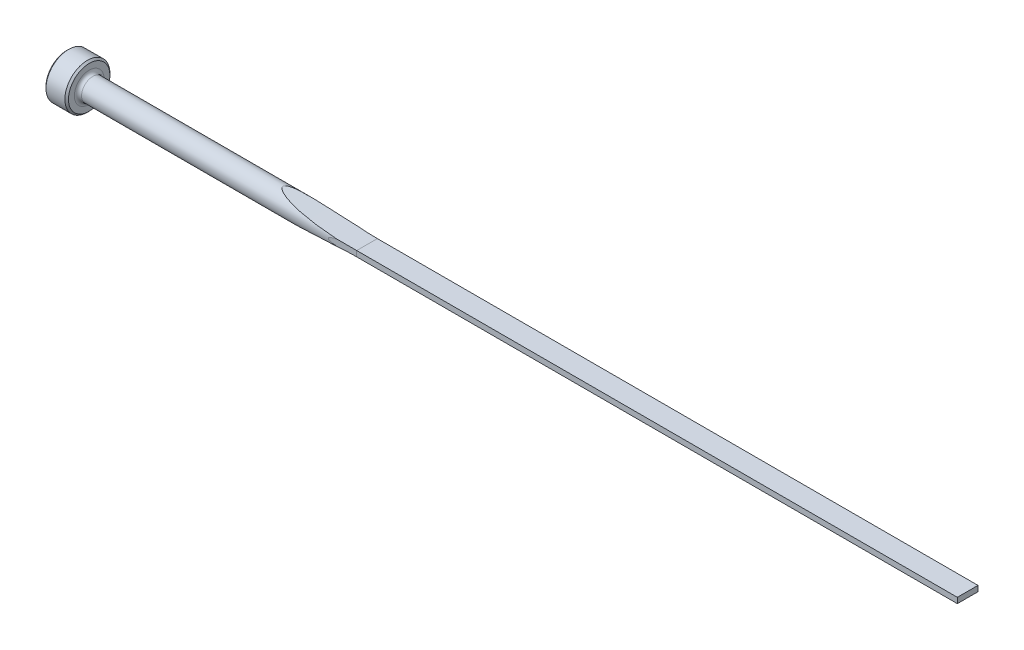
ISO-10303-21;
HEADER;
FILE_DESCRIPTION(('STEP AP214'),'2;1');
FILE_NAME('part.step','',(''),(''),'','','');
FILE_SCHEMA(('AUTOMOTIVE_DESIGN { 1 0 10303 214 1 1 1 1 }'));
ENDSEC;
DATA;
#1=APPLICATION_CONTEXT('core data for automotive mechanical design processes');
#2=APPLICATION_PROTOCOL_DEFINITION('international standard','automotive_design',2000,#1);
#3=PRODUCT_CONTEXT('',#1,'mechanical');
#4=PRODUCT('Part','Part','',(#3));
#5=PRODUCT_RELATED_PRODUCT_CATEGORY('part','',(#4));
#6=PRODUCT_DEFINITION_FORMATION('','',#4);
#7=PRODUCT_DEFINITION_CONTEXT('part definition',#1,'design');
#8=PRODUCT_DEFINITION('design','',#6,#7);
#9=PRODUCT_DEFINITION_SHAPE('','',#8);
#10=(LENGTH_UNIT() NAMED_UNIT(*) SI_UNIT(.MILLI.,.METRE.));
#11=(NAMED_UNIT(*) PLANE_ANGLE_UNIT() SI_UNIT($,.RADIAN.));
#12=(NAMED_UNIT(*) SI_UNIT($,.STERADIAN.) SOLID_ANGLE_UNIT());
#13=UNCERTAINTY_MEASURE_WITH_UNIT(LENGTH_MEASURE(1.E-05),#10,'distance_accuracy_value','');
#14=(GEOMETRIC_REPRESENTATION_CONTEXT(3) GLOBAL_UNCERTAINTY_ASSIGNED_CONTEXT((#13)) GLOBAL_UNIT_ASSIGNED_CONTEXT((#10,
#11,#12)) REPRESENTATION_CONTEXT('',''));
#15=CARTESIAN_POINT('',(0.,0.,0.));
#16=DIRECTION('',(0.,0.,1.));
#17=DIRECTION('',(1.,0.,0.));
#18=AXIS2_PLACEMENT_3D('',#15,#16,#17);
#19=CARTESIAN_POINT('',(0.,0.,0.));
#20=DIRECTION('',(-1.,0.,0.));
#21=DIRECTION('',(0.,0.,1.));
#22=AXIS2_PLACEMENT_3D('',#19,#20,#21);
#23=CYLINDRICAL_SURFACE('',#22,2.3749);
#24=CARTESIAN_POINT('',(5.5118,0.,0.));
#25=DIRECTION('',(-1.,0.,0.));
#26=DIRECTION('',(0.,0.,1.));
#27=AXIS2_PLACEMENT_3D('',#24,#25,#26);
#28=CIRCLE('',#27,2.3749);
#29=CARTESIAN_POINT('',(5.5118,0.,2.3749));
#30=VERTEX_POINT('',#29);
#31=EDGE_CURVE('E153',#30,#30,#28,.F.);
#32=ORIENTED_EDGE('',*,*,#31,.T.);
#33=EDGE_LOOP('',(#32));
#34=FACE_BOUND('',#33,.T.);
#35=CARTESIAN_POINT('',(63.5,0.931958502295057,2.18439999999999));
#36=CARTESIAN_POINT('',(63.3075515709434,0.931940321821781,2.18439976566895));
#37=CARTESIAN_POINT('',(63.1151013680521,0.930492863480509,2.18502490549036));
#38=CARTESIAN_POINT('',(62.7302234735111,0.92461137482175,2.18752450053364));
#39=CARTESIAN_POINT('',(62.5377957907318,0.920176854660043,2.18939916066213));
#40=CARTESIAN_POINT('',(62.1518341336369,0.908155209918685,2.19441218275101));
#41=CARTESIAN_POINT('',(61.9583008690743,0.900548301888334,2.19755847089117));
#42=CARTESIAN_POINT('',(61.5714442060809,0.881895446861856,2.20511052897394));
#43=CARTESIAN_POINT('',(61.3781207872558,0.870849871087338,2.20951616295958));
#44=CARTESIAN_POINT('',(60.9803005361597,0.844100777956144,2.21987943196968));
#45=CARTESIAN_POINT('',(60.7758212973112,0.828159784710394,2.2259136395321));
#46=CARTESIAN_POINT('',(60.3673129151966,0.791030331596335,2.23937732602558));
#47=CARTESIAN_POINT('',(60.1632839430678,0.769840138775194,2.24680726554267));
#48=CARTESIAN_POINT('',(59.75661740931,0.720830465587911,2.26301546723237));
#49=CARTESIAN_POINT('',(59.5539775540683,0.693029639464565,2.27178991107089));
#50=CARTESIAN_POINT('',(59.2512709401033,0.644172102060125,2.28592867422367));
#51=CARTESIAN_POINT('',(59.150603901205,0.626699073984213,2.29080303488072));
#52=CARTESIAN_POINT('',(58.9498678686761,0.588702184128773,2.30086330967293));
#53=CARTESIAN_POINT('',(58.8497987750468,0.568178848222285,2.30604917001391));
#54=CARTESIAN_POINT('',(58.7018199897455,0.534634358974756,2.31396676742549));
#55=CARTESIAN_POINT('',(58.6535509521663,0.523182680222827,2.3165891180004));
#56=CARTESIAN_POINT('',(58.5573085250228,0.499097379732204,2.32189592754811));
#57=CARTESIAN_POINT('',(58.5093351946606,0.486463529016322,2.32458039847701));
#58=CARTESIAN_POINT('',(58.3663526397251,0.446582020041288,2.33269738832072));
#59=CARTESIAN_POINT('',(58.2718724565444,0.417265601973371,2.33821536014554));
#60=CARTESIAN_POINT('',(58.1453639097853,0.370835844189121,2.34580058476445));
#61=CARTESIAN_POINT('',(58.1118331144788,0.357819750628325,2.34783049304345));
#62=CARTESIAN_POINT('',(58.0453758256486,0.330089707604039,2.35189084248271));
#63=CARTESIAN_POINT('',(58.01245087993,0.315371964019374,2.35392127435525));
#64=CARTESIAN_POINT('',(57.9466649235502,0.28318239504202,2.35801388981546));
#65=CARTESIAN_POINT('',(57.9138393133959,0.265637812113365,2.36007502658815));
#66=CARTESIAN_POINT('',(57.8503018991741,0.227094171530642,2.36409846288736));
#67=CARTESIAN_POINT('',(57.8195817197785,0.206110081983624,2.36606114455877));
#68=CARTESIAN_POINT('',(57.7807522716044,0.17363214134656,2.36855971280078));
#69=CARTESIAN_POINT('',(57.7706531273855,0.164553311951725,2.36921145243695));
#70=CARTESIAN_POINT('',(57.751335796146,0.145453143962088,2.3704611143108));
#71=CARTESIAN_POINT('',(57.7421190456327,0.135430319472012,2.3710589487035));
#72=CARTESIAN_POINT('',(57.7248924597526,0.114162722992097,2.372178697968));
#73=CARTESIAN_POINT('',(57.7168989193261,0.10290439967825,2.3726995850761));
#74=CARTESIAN_POINT('',(57.7029630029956,0.0791761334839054,2.37360916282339));
#75=CARTESIAN_POINT('',(57.6970130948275,0.0667108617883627,2.37399833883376));
#76=CARTESIAN_POINT('',(57.6895493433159,0.0451214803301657,2.37448695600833));
#77=CARTESIAN_POINT('',(57.687216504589,0.0362843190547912,2.37463982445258));
#78=CARTESIAN_POINT('',(57.684070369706,0.018342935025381,2.3748460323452));
#79=CARTESIAN_POINT('',(57.68325542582,0.00923901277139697,2.37489947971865));
#80=CARTESIAN_POINT('',(57.6832396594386,-0.00898512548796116,2.37490051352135));
#81=CARTESIAN_POINT('',(57.6840414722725,-0.0181053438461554,2.37484792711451));
#82=CARTESIAN_POINT('',(57.6871682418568,-0.0360804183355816,2.37464298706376));
#83=CARTESIAN_POINT('',(57.6894948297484,-0.0449349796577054,2.37449052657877));
#84=CARTESIAN_POINT('',(57.696426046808,-0.0650505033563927,2.37403676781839));
#85=CARTESIAN_POINT('',(57.7015301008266,-0.0761364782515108,2.37370288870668));
#86=CARTESIAN_POINT('',(57.7134090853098,-0.0973644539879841,2.37292722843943));
#87=CARTESIAN_POINT('',(57.720188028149,-0.10750410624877,2.37248518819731));
#88=CARTESIAN_POINT('',(57.7406526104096,-0.134467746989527,2.37115359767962));
#89=CARTESIAN_POINT('',(57.7555945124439,-0.150320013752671,2.37018436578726));
#90=CARTESIAN_POINT('',(57.7874630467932,-0.179846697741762,2.36812651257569));
#91=CARTESIAN_POINT('',(57.8043958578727,-0.193514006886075,2.36703752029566));
#92=CARTESIAN_POINT('',(57.8500057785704,-0.226993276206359,2.36411848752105));
#93=CARTESIAN_POINT('',(57.8796018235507,-0.245533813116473,2.36223795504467));
#94=CARTESIAN_POINT('',(57.9403493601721,-0.279898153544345,2.3584104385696));
#95=CARTESIAN_POINT('',(57.9715045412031,-0.295715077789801,2.35646330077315));
#96=CARTESIAN_POINT('',(58.0666093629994,-0.34041895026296,2.35057165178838));
#97=CARTESIAN_POINT('',(58.1319170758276,-0.366382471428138,2.34659497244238));
#98=CARTESIAN_POINT('',(58.2741782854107,-0.417382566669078,2.3380950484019));
#99=CARTESIAN_POINT('',(58.3513848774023,-0.441669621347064,2.33358126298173));
#100=CARTESIAN_POINT('',(58.506961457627,-0.486276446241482,2.32469268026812));
#101=CARTESIAN_POINT('',(58.5853319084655,-0.506594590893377,2.32031794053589));
#102=CARTESIAN_POINT('',(58.8218439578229,-0.563416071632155,2.30743335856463));
#103=CARTESIAN_POINT('',(58.9810064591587,-0.595665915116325,2.29918591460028));
#104=CARTESIAN_POINT('',(59.3005735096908,-0.653182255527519,2.28349651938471));
#105=CARTESIAN_POINT('',(59.46097818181,-0.678448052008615,2.27605464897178));
#106=CARTESIAN_POINT('',(59.7823165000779,-0.723854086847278,2.26202300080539));
#107=CARTESIAN_POINT('',(59.9432491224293,-0.744001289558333,2.25543207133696));
#108=CARTESIAN_POINT('',(60.3686966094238,-0.792003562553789,2.23917011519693));
#109=CARTESIAN_POINT('',(60.6336093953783,-0.816543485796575,2.23022625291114));
#110=CARTESIAN_POINT('',(61.1642384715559,-0.857758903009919,2.21469349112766));
#111=CARTESIAN_POINT('',(61.4299551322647,-0.874429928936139,2.20810593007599));
#112=CARTESIAN_POINT('',(61.9612705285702,-0.901186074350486,2.19732116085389));
#113=CARTESIAN_POINT('',(62.2268685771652,-0.911283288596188,2.19311956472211));
#114=CARTESIAN_POINT('',(62.7582486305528,-0.925643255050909,2.18709742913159));
#115=CARTESIAN_POINT('',(63.0240306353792,-0.929906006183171,2.18527689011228));
#116=CARTESIAN_POINT('',(63.3598826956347,-0.931763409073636,2.18448280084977));
#117=CARTESIAN_POINT('',(63.4299416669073,-0.931956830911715,2.18439997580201));
#118=CARTESIAN_POINT('',(63.5,-0.931958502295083,2.18439999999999));
#119=B_SPLINE_CURVE_WITH_KNOTS('',3,(#35,#36,#37,#38,#39,#40,#41,#42,#43,#44,#45,#46,#47,#48,
#49,#50,#51,#52,#53,#54,#55,#56,#57,#58,#59,#60,#61,#62,#63,#64,#65,#66,#67,#68,#69,#70,#71,#72,
#73,#74,#75,#76,#77,#78,#79,#80,#81,#82,#83,#84,#85,#86,#87,#88,#89,#90,#91,#92,#93,#94,#95,#96,
#97,#98,#99,#100,#101,#102,#103,#104,#105,#106,#107,#108,#109,#110,#111,#112,#113,#114,#115,
#116,#117,#118),.UNSPECIFIED.,.F.,.F.,(4,2,2,2,2,2,2,2,2,2,2,2,2,2,2,2,2,2,2,2,2,2,2,2,2,2,2,2,
2,2,2,2,2,2,2,2,2,2,2,2,2,4),(0.,0.577341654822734,1.15477801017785,1.73587049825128,
2.31690027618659,2.93240275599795,3.5481087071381,4.16209742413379,4.46893047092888,
4.77571068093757,4.9247288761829,5.07377599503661,5.37061535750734,5.47866452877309,
5.58695943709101,5.69870175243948,5.80997010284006,5.85071283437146,5.89152080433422,
5.93283229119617,5.97398983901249,6.00129967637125,6.02857985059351,6.05590452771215,
6.08325848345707,6.11967760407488,6.1561848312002,6.22123367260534,6.28649000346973,
6.39114062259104,6.49605180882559,6.70686384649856,6.94992813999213,7.19309177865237,
7.68061293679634,8.16818297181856,8.65508602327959,9.45349626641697,10.2523593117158,
11.0497483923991,11.8471376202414,12.0573140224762),.UNSPECIFIED.);
#120=CARTESIAN_POINT('',(59.4532230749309,0.676353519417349,2.2765535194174));
#121=VERTEX_POINT('',#120);
#122=CARTESIAN_POINT('',(59.4532230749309,-0.676353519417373,2.27655351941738));
#123=VERTEX_POINT('',#122);
#124=EDGE_CURVE('E156',#121,#123,#119,.T.);
#125=ORIENTED_EDGE('',*,*,#124,.F.);
#126=CARTESIAN_POINT('',(63.5,0.584200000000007,2.30192536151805));
#127=CARTESIAN_POINT('',(63.1039180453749,0.584199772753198,2.30190417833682));
#128=CARTESIAN_POINT('',(62.707835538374,0.586847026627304,2.30125273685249));
#129=CARTESIAN_POINT('',(61.9157304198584,0.597435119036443,2.29853811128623));
#130=CARTESIAN_POINT('',(61.5197078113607,0.605376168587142,2.29647487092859));
#131=CARTESIAN_POINT('',(60.7279546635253,0.626546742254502,2.29078640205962));
#132=CARTESIAN_POINT('',(60.3322240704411,0.639774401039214,2.28716172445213));
#133=CARTESIAN_POINT('',(59.5410087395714,0.671514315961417,2.27804604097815));
#134=CARTESIAN_POINT('',(59.1455239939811,0.690026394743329,2.27255509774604));
#135=CARTESIAN_POINT('',(58.3976970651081,0.730038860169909,2.25999615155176));
#136=CARTESIAN_POINT('',(58.0453219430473,0.750998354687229,2.25316339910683));
#137=CARTESIAN_POINT('',(57.3408962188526,0.797109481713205,2.23726666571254));
#138=CARTESIAN_POINT('',(56.9888456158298,0.822261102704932,2.22820269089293));
#139=CARTESIAN_POINT('',(56.2850467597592,0.876756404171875,2.20732879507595));
#140=CARTESIAN_POINT('',(55.9332986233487,0.906101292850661,2.19551808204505));
#141=CARTESIAN_POINT('',(55.2303074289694,0.968965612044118,2.16850805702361));
#142=CARTESIAN_POINT('',(54.8790643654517,1.00248499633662,2.15330878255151));
#143=CARTESIAN_POINT('',(54.1763139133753,1.07377116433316,2.11866504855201));
#144=CARTESIAN_POINT('',(53.8248081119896,1.11154849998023,2.09920992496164));
#145=CARTESIAN_POINT('',(53.1226006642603,1.19125330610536,2.05502934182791));
#146=CARTESIAN_POINT('',(52.7718990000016,1.23318068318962,2.03030400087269));
#147=CARTESIAN_POINT('',(52.0717363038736,1.32111697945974,1.97421388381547));
#148=CARTESIAN_POINT('',(51.7222746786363,1.36712355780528,1.94285290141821));
#149=CARTESIAN_POINT('',(51.0247913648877,1.46316246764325,1.87160394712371));
#150=CARTESIAN_POINT('',(50.6767695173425,1.51319434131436,1.83171694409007));
#151=CARTESIAN_POINT('',(50.0579696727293,1.60588993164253,1.75048141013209));
#152=CARTESIAN_POINT('',(49.7867933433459,1.64780133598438,1.71132205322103));
#153=CARTESIAN_POINT('',(49.2460228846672,1.73393450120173,1.624013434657));
#154=CARTESIAN_POINT('',(48.9764299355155,1.77815778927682,1.57585817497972));
#155=CARTESIAN_POINT('',(48.5748608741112,1.84591760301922,1.49464223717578));
#156=CARTESIAN_POINT('',(48.4418265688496,1.86867894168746,1.46616112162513));
#157=CARTESIAN_POINT('',(48.1766687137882,1.91466412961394,1.40558316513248));
#158=CARTESIAN_POINT('',(48.0445450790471,1.93788793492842,1.37348666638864));
#159=CARTESIAN_POINT('',(47.781651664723,1.98470665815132,1.3049180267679));
#160=CARTESIAN_POINT('',(47.6508805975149,2.0083011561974,1.26845056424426));
#161=CARTESIAN_POINT('',(47.3910740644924,2.0557726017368,1.1899848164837));
#162=CARTESIAN_POINT('',(47.2620380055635,2.07964944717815,1.14798847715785));
#163=CARTESIAN_POINT('',(47.0842278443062,2.11295170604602,1.08443009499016));
#164=CARTESIAN_POINT('',(47.0343377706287,2.12234035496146,1.0659618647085));
#165=CARTESIAN_POINT('',(46.9350481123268,2.14111257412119,1.02773562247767));
#166=CARTESIAN_POINT('',(46.8856485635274,2.1504961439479,1.00797751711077));
#167=CARTESIAN_POINT('',(46.7381143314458,2.17864907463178,0.946408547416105));
#168=CARTESIAN_POINT('',(46.6408815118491,2.19737615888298,0.902385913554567));
#169=CARTESIAN_POINT('',(46.4494527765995,2.2345675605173,0.805968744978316));
#170=CARTESIAN_POINT('',(46.355286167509,2.25302872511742,0.753512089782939));
#171=CARTESIAN_POINT('',(46.2196893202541,2.27982508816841,0.665927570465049));
#172=CARTESIAN_POINT('',(46.1754709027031,2.28860026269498,0.635281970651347));
#173=CARTESIAN_POINT('',(46.0898011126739,2.3056655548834,0.57025592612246));
#174=CARTESIAN_POINT('',(46.048346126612,2.31395630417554,0.535880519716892));
#175=CARTESIAN_POINT('',(45.9739556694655,2.32888433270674,0.466440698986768));
#176=CARTESIAN_POINT('',(45.9405846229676,2.33560318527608,0.431867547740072));
#177=CARTESIAN_POINT('',(45.87903553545,2.34802733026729,0.358199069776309));
#178=CARTESIAN_POINT('',(45.8508422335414,2.35373559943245,0.319117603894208));
#179=CARTESIAN_POINT('',(45.8113921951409,2.36173788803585,0.251097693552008));
#180=CARTESIAN_POINT('',(45.7977056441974,2.36451845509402,0.223643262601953));
#181=CARTESIAN_POINT('',(45.7746812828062,2.36920006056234,0.166880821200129));
#182=CARTESIAN_POINT('',(45.765338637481,2.37110207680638,0.137574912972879));
#183=CARTESIAN_POINT('',(45.7519357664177,2.37383169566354,0.077375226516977));
#184=CARTESIAN_POINT('',(45.7479303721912,2.37464814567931,0.0464683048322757));
#185=CARTESIAN_POINT('',(45.7459527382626,2.37505118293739,-0.0155437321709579));
#186=CARTESIAN_POINT('',(45.7479779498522,2.37463828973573,-0.0466487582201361));
#187=CARTESIAN_POINT('',(45.7571294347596,2.37277388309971,-0.103988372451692));
#188=CARTESIAN_POINT('',(45.7635780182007,2.3714603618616,-0.130341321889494));
#189=CARTESIAN_POINT('',(45.7802195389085,2.36807375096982,-0.181774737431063));
#190=CARTESIAN_POINT('',(45.7904148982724,2.36600016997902,-0.206854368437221));
#191=CARTESIAN_POINT('',(45.8210543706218,2.35977604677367,-0.270501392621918));
#192=CARTESIAN_POINT('',(45.8439397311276,2.35513360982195,-0.307835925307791));
#193=CARTESIAN_POINT('',(45.8949663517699,2.34480895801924,-0.378560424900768));
#194=CARTESIAN_POINT('',(45.9231243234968,2.3391234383,-0.411937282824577));
#195=CARTESIAN_POINT('',(45.9821623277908,2.32723671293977,-0.47445075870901));
#196=CARTESIAN_POINT('',(46.0129577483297,2.32105175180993,-0.50367187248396));
#197=CARTESIAN_POINT('',(46.0768582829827,2.30825608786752,-0.559393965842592));
#198=CARTESIAN_POINT('',(46.1099657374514,2.30164495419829,-0.58589212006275));
#199=CARTESIAN_POINT('',(46.1778950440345,2.28812278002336,-0.63665938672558));
#200=CARTESIAN_POINT('',(46.2127206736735,2.2812110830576,-0.660923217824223));
#201=CARTESIAN_POINT('',(46.2835749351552,2.26719469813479,-0.707508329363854));
#202=CARTESIAN_POINT('',(46.3196029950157,2.26009010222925,-0.729830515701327));
#203=CARTESIAN_POINT('',(46.4193208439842,2.24049225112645,-0.788603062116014));
#204=CARTESIAN_POINT('',(46.4839423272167,2.22786370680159,-0.823425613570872));
#205=CARTESIAN_POINT('',(46.6150574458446,2.20239666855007,-0.889289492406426));
#206=CARTESIAN_POINT('',(46.6815521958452,2.18955805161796,-0.920328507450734));
#207=CARTESIAN_POINT('',(46.8832427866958,2.15086101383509,-1.00903580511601));
#208=CARTESIAN_POINT('',(47.0204047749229,2.12486869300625,-1.06216197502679));
#209=CARTESIAN_POINT('',(47.2983336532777,2.07289549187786,-1.16030862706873));
#210=CARTESIAN_POINT('',(47.4391157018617,2.04691538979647,-1.20528503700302));
#211=CARTESIAN_POINT('',(47.6516302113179,2.0082355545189,-1.2679652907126));
#212=CARTESIAN_POINT('',(47.722646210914,1.99539876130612,-1.28805002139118));
#213=CARTESIAN_POINT('',(47.865076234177,1.96983321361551,-1.32681812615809));
#214=CARTESIAN_POINT('',(47.9364902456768,1.95710445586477,-1.34550154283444));
#215=CARTESIAN_POINT('',(48.177240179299,1.91449900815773,-1.40626226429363));
#216=CARTESIAN_POINT('',(48.3473429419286,1.88490221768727,-1.44550743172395));
#217=CARTESIAN_POINT('',(48.6888493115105,1.82651439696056,-1.51860908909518));
#218=CARTESIAN_POINT('',(48.8602531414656,1.7977235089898,-1.5524646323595));
#219=CARTESIAN_POINT('',(49.2041032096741,1.74100817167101,-1.61581220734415));
#220=CARTESIAN_POINT('',(49.3765499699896,1.71308420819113,-1.64530182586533));
#221=CARTESIAN_POINT('',(49.7221786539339,1.65816588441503,-1.7006319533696));
#222=CARTESIAN_POINT('',(49.8953606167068,1.63117157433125,-1.72647226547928));
#223=CARTESIAN_POINT('',(50.4166265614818,1.5515036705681,-1.7995052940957));
#224=CARTESIAN_POINT('',(50.7655846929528,1.5002847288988,-1.84206059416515));
#225=CARTESIAN_POINT('',(51.4649208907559,1.4019000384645,-1.91798244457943));
#226=CARTESIAN_POINT('',(51.8152984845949,1.35473304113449,-1.95135183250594));
#227=CARTESIAN_POINT('',(52.5171139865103,1.26452328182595,-2.01098287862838));
#228=CARTESIAN_POINT('',(52.8685516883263,1.2214797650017,-2.03724583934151));
#229=CARTESIAN_POINT('',(53.5723038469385,1.13955464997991,-2.08417582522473));
#230=CARTESIAN_POINT('',(53.9246183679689,1.10067336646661,-2.10484242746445));
#231=CARTESIAN_POINT('',(54.6294524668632,1.02715522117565,-2.14167915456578));
#232=CARTESIAN_POINT('',(54.9819711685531,0.992512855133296,-2.15785514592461));
#233=CARTESIAN_POINT('',(55.6875446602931,0.927432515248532,-2.18661373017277));
#234=CARTESIAN_POINT('',(56.0405994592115,0.896994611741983,-2.1991962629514));
#235=CARTESIAN_POINT('',(56.972757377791,0.822244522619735,-2.22858098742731));
#236=CARTESIAN_POINT('',(57.5522254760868,0.781486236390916,-2.2429460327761));
#237=CARTESIAN_POINT('',(58.7121149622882,0.711322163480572,-2.26616952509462));
#238=CARTESIAN_POINT('',(59.2925365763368,0.68191964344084,-2.27502638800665));
#239=CARTESIAN_POINT('',(60.4531592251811,0.634531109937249,-2.28869549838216));
#240=CARTESIAN_POINT('',(61.033359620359,0.616530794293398,-2.29351281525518));
#241=CARTESIAN_POINT('',(62.1940149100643,0.591898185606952,-2.29999341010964));
#242=CARTESIAN_POINT('',(62.7744697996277,0.585265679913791,-2.30165674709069));
#243=CARTESIAN_POINT('',(63.4032799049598,0.584239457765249,-2.3019151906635));
#244=CARTESIAN_POINT('',(63.4516400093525,0.584199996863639,-2.301925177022));
#245=CARTESIAN_POINT('',(63.5,0.584199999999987,-2.30192536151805));
#246=B_SPLINE_CURVE_WITH_KNOTS('',3,(#126,#127,#128,#129,#130,#131,#132,#133,#134,#135,#136,
#137,#138,#139,#140,#141,#142,#143,#144,#145,#146,#147,#148,#149,#150,#151,#152,#153,#154,#155,
#156,#157,#158,#159,#160,#161,#162,#163,#164,#165,#166,#167,#168,#169,#170,#171,#172,#173,#174,
#175,#176,#177,#178,#179,#180,#181,#182,#183,#184,#185,#186,#187,#188,#189,#190,#191,#192,#193,
#194,#195,#196,#197,#198,#199,#200,#201,#202,#203,#204,#205,#206,#207,#208,#209,#210,#211,#212,
#213,#214,#215,#216,#217,#218,#219,#220,#221,#222,#223,#224,#225,#226,#227,#228,#229,#230,#231,
#232,#233,#234,#235,#236,#237,#238,#239,#240,#241,#242,#243,#244,#245),.UNSPECIFIED.,.F.,.F.,(4,
2,2,2,2,2,2,2,2,2,2,2,2,2,2,2,2,2,2,2,2,2,2,2,2,2,2,2,2,2,2,2,2,2,2,2,2,2,2,2,2,2,2,2,2,2,2,2,2,
2,2,2,2,2,2,2,2,2,2,4),(0.,1.18823739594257,2.37652215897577,3.56438801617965,4.75221401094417,
5.81137600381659,6.87053508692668,7.92999996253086,8.9894531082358,10.0515920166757,
11.1137070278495,12.1752164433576,13.2366052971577,14.0680245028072,14.9000000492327,
15.3137808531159,15.7275225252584,16.1408252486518,16.5539828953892,16.716030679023,
16.8780902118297,17.2029743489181,17.5303713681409,17.6937674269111,17.8569454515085,
18.002183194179,18.1469857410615,18.2390964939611,18.3311044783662,18.4240505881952,
18.5169574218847,18.5981115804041,18.6793182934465,18.8106633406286,18.9424319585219,
19.0709395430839,19.1995791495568,19.3285154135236,19.4573911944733,19.680665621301,
19.9040758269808,20.351727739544,20.8017325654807,21.0264483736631,21.2511573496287,
21.7822142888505,22.3133644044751,22.844807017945,23.3762782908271,24.441829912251,
25.5070520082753,26.5720787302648,27.6371859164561,28.7008950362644,29.7646219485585,
31.5076931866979,33.2512654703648,34.9926463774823,36.7339947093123,36.8790749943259),.UNSPECIFIED.);
#247=CARTESIAN_POINT('',(59.4532230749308,0.67635351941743,-2.27655351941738));
#248=VERTEX_POINT('',#247);
#249=EDGE_CURVE('E106',#121,#248,#246,.T.);
#250=ORIENTED_EDGE('',*,*,#249,.T.);
#251=CARTESIAN_POINT('',(63.5,0.931958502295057,-2.18439999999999));
#252=CARTESIAN_POINT('',(63.3075515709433,0.931940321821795,-2.18439976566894));
#253=CARTESIAN_POINT('',(63.115101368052,0.930492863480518,-2.18502490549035));
#254=CARTESIAN_POINT('',(62.7302234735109,0.924611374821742,-2.18752450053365));
#255=CARTESIAN_POINT('',(62.5377957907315,0.920176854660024,-2.18939916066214));
#256=CARTESIAN_POINT('',(62.1518341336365,0.908155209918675,-2.19441218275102));
#257=CARTESIAN_POINT('',(61.9583008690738,0.900548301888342,-2.19755847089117));
#258=CARTESIAN_POINT('',(61.5714442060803,0.881895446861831,-2.20511052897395));
#259=CARTESIAN_POINT('',(61.3781207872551,0.870849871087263,-2.20951616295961));
#260=CARTESIAN_POINT('',(60.980300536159,0.844100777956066,-2.21987943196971));
#261=CARTESIAN_POINT('',(60.7758212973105,0.828159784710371,-2.22591363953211));
#262=CARTESIAN_POINT('',(60.3673129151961,0.791030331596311,-2.23937732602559));
#263=CARTESIAN_POINT('',(60.1632839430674,0.769840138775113,-2.2468072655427));
#264=CARTESIAN_POINT('',(59.7566174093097,0.720830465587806,-2.26301546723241));
#265=CARTESIAN_POINT('',(59.5539775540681,0.693029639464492,-2.27178991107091));
#266=CARTESIAN_POINT('',(59.2512709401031,0.644172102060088,-2.28592867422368));
#267=CARTESIAN_POINT('',(59.1506039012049,0.626699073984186,-2.29080303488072));
#268=CARTESIAN_POINT('',(58.949867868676,0.588702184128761,-2.30086330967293));
#269=CARTESIAN_POINT('',(58.8497987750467,0.568178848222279,-2.30604917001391));
#270=CARTESIAN_POINT('',(58.7018199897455,0.534634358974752,-2.31396676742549));
#271=CARTESIAN_POINT('',(58.6535509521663,0.523182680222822,-2.31658911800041));
#272=CARTESIAN_POINT('',(58.5573085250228,0.499097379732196,-2.32189592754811));
#273=CARTESIAN_POINT('',(58.5093351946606,0.486463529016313,-2.32458039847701));
#274=CARTESIAN_POINT('',(58.3663526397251,0.446582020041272,-2.33269738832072));
#275=CARTESIAN_POINT('',(58.2718724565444,0.417265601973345,-2.33821536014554));
#276=CARTESIAN_POINT('',(58.1453639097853,0.370835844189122,-2.34580058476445));
#277=CARTESIAN_POINT('',(58.1118331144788,0.357819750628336,-2.34783049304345));
#278=CARTESIAN_POINT('',(58.0453758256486,0.330089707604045,-2.35189084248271));
#279=CARTESIAN_POINT('',(58.01245087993,0.315371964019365,-2.35392127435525));
#280=CARTESIAN_POINT('',(57.9466649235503,0.28318239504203,-2.35801388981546));
#281=CARTESIAN_POINT('',(57.9138393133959,0.265637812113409,-2.36007502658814));
#282=CARTESIAN_POINT('',(57.8503018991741,0.227094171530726,-2.36409846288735));
#283=CARTESIAN_POINT('',(57.8195817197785,0.206110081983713,-2.36606114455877));
#284=CARTESIAN_POINT('',(57.7807522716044,0.173632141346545,-2.36855971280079));
#285=CARTESIAN_POINT('',(57.7706531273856,0.164553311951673,-2.36921145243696));
#286=CARTESIAN_POINT('',(57.751335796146,0.145453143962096,-2.3704611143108));
#287=CARTESIAN_POINT('',(57.7421190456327,0.135430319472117,-2.37105894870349));
#288=CARTESIAN_POINT('',(57.7248924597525,0.114162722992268,-2.37217869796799));
#289=CARTESIAN_POINT('',(57.716898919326,0.102904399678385,-2.37269958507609));
#290=CARTESIAN_POINT('',(57.7029630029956,0.0791761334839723,-2.37360916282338));
#291=CARTESIAN_POINT('',(57.6970130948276,0.0667108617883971,-2.37399833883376));
#292=CARTESIAN_POINT('',(57.6895493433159,0.0451214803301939,-2.37448695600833));
#293=CARTESIAN_POINT('',(57.6872165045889,0.0362843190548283,-2.37463982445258));
#294=CARTESIAN_POINT('',(57.684070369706,0.0183429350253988,-2.3748460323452));
#295=CARTESIAN_POINT('',(57.6832554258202,0.00923901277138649,-2.37489947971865));
#296=CARTESIAN_POINT('',(57.6832396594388,-0.00898512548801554,-2.37490051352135));
#297=CARTESIAN_POINT('',(57.6840414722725,-0.0181053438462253,-2.37484792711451));
#298=CARTESIAN_POINT('',(57.6871682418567,-0.0360804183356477,-2.37464298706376));
#299=CARTESIAN_POINT('',(57.6894948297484,-0.0449349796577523,-2.37449052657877));
#300=CARTESIAN_POINT('',(57.6964260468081,-0.0650505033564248,-2.37403676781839));
#301=CARTESIAN_POINT('',(57.7015301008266,-0.0761364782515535,-2.37370288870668));
#302=CARTESIAN_POINT('',(57.7134090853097,-0.0973644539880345,-2.37292722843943));
#303=CARTESIAN_POINT('',(57.720188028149,-0.107504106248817,-2.3724851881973));
#304=CARTESIAN_POINT('',(57.7406526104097,-0.134467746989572,-2.37115359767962));
#305=CARTESIAN_POINT('',(57.755594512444,-0.15032001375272,-2.37018436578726));
#306=CARTESIAN_POINT('',(57.7874630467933,-0.179846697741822,-2.36812651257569));
#307=CARTESIAN_POINT('',(57.8043958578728,-0.193514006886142,-2.36703752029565));
#308=CARTESIAN_POINT('',(57.8500057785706,-0.226993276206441,-2.36411848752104));
#309=CARTESIAN_POINT('',(57.8796018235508,-0.245533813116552,-2.36223795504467));
#310=CARTESIAN_POINT('',(57.9403493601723,-0.279898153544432,-2.35841043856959));
#311=CARTESIAN_POINT('',(57.9715045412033,-0.295715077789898,-2.35646330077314));
#312=CARTESIAN_POINT('',(58.0666093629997,-0.340418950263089,-2.35057165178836));
#313=CARTESIAN_POINT('',(58.1319170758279,-0.36638247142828,-2.34659497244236));
#314=CARTESIAN_POINT('',(58.2741782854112,-0.41738256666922,-2.33809504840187));
#315=CARTESIAN_POINT('',(58.3513848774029,-0.441669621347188,-2.33358126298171));
#316=CARTESIAN_POINT('',(58.5069614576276,-0.486276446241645,-2.32469268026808));
#317=CARTESIAN_POINT('',(58.5853319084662,-0.506594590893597,-2.32031794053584));
#318=CARTESIAN_POINT('',(58.8218439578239,-0.563416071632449,-2.30743335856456));
#319=CARTESIAN_POINT('',(58.9810064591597,-0.595665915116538,-2.29918591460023));
#320=CARTESIAN_POINT('',(59.3005735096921,-0.653182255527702,-2.28349651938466));
#321=CARTESIAN_POINT('',(59.4609781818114,-0.678448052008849,-2.27605464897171));
#322=CARTESIAN_POINT('',(59.7823165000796,-0.723854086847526,-2.26202300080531));
#323=CARTESIAN_POINT('',(59.9432491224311,-0.744001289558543,-2.25543207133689));
#324=CARTESIAN_POINT('',(60.3686966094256,-0.792003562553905,-2.23917011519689));
#325=CARTESIAN_POINT('',(60.6336093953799,-0.816543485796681,-2.2302262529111));
#326=CARTESIAN_POINT('',(61.1642384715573,-0.857758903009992,-2.21469349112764));
#327=CARTESIAN_POINT('',(61.4299551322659,-0.874429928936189,-2.20810593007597));
#328=CARTESIAN_POINT('',(61.9612705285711,-0.901186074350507,-2.19732116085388));
#329=CARTESIAN_POINT('',(62.226868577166,-0.911283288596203,-2.1931195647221));
#330=CARTESIAN_POINT('',(62.7582486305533,-0.925643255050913,-2.18709742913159));
#331=CARTESIAN_POINT('',(63.0240306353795,-0.929906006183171,-2.18527689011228));
#332=CARTESIAN_POINT('',(63.3598826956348,-0.931763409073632,-2.18448280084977));
#333=CARTESIAN_POINT('',(63.4299416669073,-0.931956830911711,-2.18439997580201));
#334=CARTESIAN_POINT('',(63.5,-0.931958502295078,-2.18439999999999));
#335=B_SPLINE_CURVE_WITH_KNOTS('',3,(#251,#252,#253,#254,#255,#256,#257,#258,#259,#260,#261,
#262,#263,#264,#265,#266,#267,#268,#269,#270,#271,#272,#273,#274,#275,#276,#277,#278,#279,#280,
#281,#282,#283,#284,#285,#286,#287,#288,#289,#290,#291,#292,#293,#294,#295,#296,#297,#298,#299,
#300,#301,#302,#303,#304,#305,#306,#307,#308,#309,#310,#311,#312,#313,#314,#315,#316,#317,#318,
#319,#320,#321,#322,#323,#324,#325,#326,#327,#328,#329,#330,#331,#332,#333,#334),.UNSPECIFIED.,
.F.,.F.,(4,2,2,2,2,2,2,2,2,2,2,2,2,2,2,2,2,2,2,2,2,2,2,2,2,2,2,2,2,2,2,2,2,2,2,2,2,2,2,2,2,4),
(0.,0.577341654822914,1.15477801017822,1.73587049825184,2.31690027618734,2.9324027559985,
3.54810870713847,4.16209742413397,4.46893047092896,4.77571068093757,4.92472887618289,
5.0737759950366,5.37061535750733,5.47866452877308,5.58695943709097,5.69870175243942,
5.80997010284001,5.85071283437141,5.89152080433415,5.93283229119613,5.97398983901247,
6.00129967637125,6.02857985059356,6.05590452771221,6.08325848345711,6.11967760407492,
6.15618483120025,6.22123367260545,6.28649000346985,6.39114062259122,6.49605180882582,
6.70686384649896,6.94992813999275,7.19309177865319,7.68061293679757,8.16818297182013,
8.65508602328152,9.45349626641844,10.2523593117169,11.0497483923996,11.8471376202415,
12.0573140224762),.UNSPECIFIED.);
#336=CARTESIAN_POINT('',(59.4532230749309,-0.676353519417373,-2.27655351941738));
#337=VERTEX_POINT('',#336);
#338=EDGE_CURVE('E175',#248,#337,#335,.T.);
#339=ORIENTED_EDGE('',*,*,#338,.T.);
#340=CARTESIAN_POINT('',(63.5,-0.584200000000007,2.30192536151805));
#341=CARTESIAN_POINT('',(63.1039180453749,-0.584199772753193,2.30190417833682));
#342=CARTESIAN_POINT('',(62.707835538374,-0.586847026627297,2.30125273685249));
#343=CARTESIAN_POINT('',(61.9157304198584,-0.597435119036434,2.29853811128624));
#344=CARTESIAN_POINT('',(61.5197078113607,-0.605376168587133,2.2964748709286));
#345=CARTESIAN_POINT('',(60.7279546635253,-0.626546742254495,2.29078640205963));
#346=CARTESIAN_POINT('',(60.3322240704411,-0.639774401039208,2.28716172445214));
#347=CARTESIAN_POINT('',(59.5410087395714,-0.671514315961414,2.27804604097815));
#348=CARTESIAN_POINT('',(59.1455239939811,-0.690026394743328,2.27255509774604));
#349=CARTESIAN_POINT('',(58.3976970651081,-0.730038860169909,2.25999615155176));
#350=CARTESIAN_POINT('',(58.0453219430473,-0.750998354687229,2.25316339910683));
#351=CARTESIAN_POINT('',(57.3408962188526,-0.797109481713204,2.23726666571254));
#352=CARTESIAN_POINT('',(56.9888456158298,-0.82226110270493,2.22820269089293));
#353=CARTESIAN_POINT('',(56.2850467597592,-0.876756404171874,2.20732879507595));
#354=CARTESIAN_POINT('',(55.9332986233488,-0.906101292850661,2.19551808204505));
#355=CARTESIAN_POINT('',(55.2303074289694,-0.968965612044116,2.16850805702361));
#356=CARTESIAN_POINT('',(54.8790643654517,-1.00248499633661,2.15330878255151));
#357=CARTESIAN_POINT('',(54.1763139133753,-1.07377116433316,2.11866504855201));
#358=CARTESIAN_POINT('',(53.8248081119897,-1.11154849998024,2.09920992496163));
#359=CARTESIAN_POINT('',(53.1226006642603,-1.19125330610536,2.05502934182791));
#360=CARTESIAN_POINT('',(52.7718990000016,-1.23318068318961,2.0303040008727));
#361=CARTESIAN_POINT('',(52.0717363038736,-1.32111697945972,1.97421388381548));
#362=CARTESIAN_POINT('',(51.7222746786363,-1.36712355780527,1.94285290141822));
#363=CARTESIAN_POINT('',(51.0247913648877,-1.46316246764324,1.87160394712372));
#364=CARTESIAN_POINT('',(50.6767695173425,-1.51319434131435,1.83171694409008));
#365=CARTESIAN_POINT('',(50.0579696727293,-1.60588993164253,1.75048141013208));
#366=CARTESIAN_POINT('',(49.7867933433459,-1.64780133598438,1.71132205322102));
#367=CARTESIAN_POINT('',(49.2460228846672,-1.73393450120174,1.624013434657));
#368=CARTESIAN_POINT('',(48.9764299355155,-1.77815778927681,1.57585817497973));
#369=CARTESIAN_POINT('',(48.5748608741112,-1.84591760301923,1.49464223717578));
#370=CARTESIAN_POINT('',(48.4418265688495,-1.86867894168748,1.46616112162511));
#371=CARTESIAN_POINT('',(48.1766687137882,-1.91466412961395,1.40558316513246));
#372=CARTESIAN_POINT('',(48.0445450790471,-1.93788793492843,1.37348666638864));
#373=CARTESIAN_POINT('',(47.781651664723,-1.98470665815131,1.30491802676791));
#374=CARTESIAN_POINT('',(47.6508805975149,-2.00830115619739,1.26845056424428));
#375=CARTESIAN_POINT('',(47.3910740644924,-2.05577260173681,1.18998481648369));
#376=CARTESIAN_POINT('',(47.2620380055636,-2.07964944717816,1.14798847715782));
#377=CARTESIAN_POINT('',(47.0842278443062,-2.11295170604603,1.08443009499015));
#378=CARTESIAN_POINT('',(47.0343377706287,-2.12234035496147,1.06596186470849));
#379=CARTESIAN_POINT('',(46.9350481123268,-2.14111257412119,1.02773562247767));
#380=CARTESIAN_POINT('',(46.8856485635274,-2.1504961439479,1.00797751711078));
#381=CARTESIAN_POINT('',(46.7381143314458,-2.17864907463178,0.946408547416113));
#382=CARTESIAN_POINT('',(46.6408815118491,-2.19737615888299,0.902385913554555));
#383=CARTESIAN_POINT('',(46.4494527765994,-2.23456756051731,0.805968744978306));
#384=CARTESIAN_POINT('',(46.3552861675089,-2.25302872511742,0.753512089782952));
#385=CARTESIAN_POINT('',(46.219689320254,-2.27982508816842,0.665927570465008));
#386=CARTESIAN_POINT('',(46.1754709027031,-2.288600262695,0.635281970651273));
#387=CARTESIAN_POINT('',(46.0898011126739,-2.30566555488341,0.570255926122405));
#388=CARTESIAN_POINT('',(46.0483461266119,-2.31395630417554,0.53588051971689));
#389=CARTESIAN_POINT('',(45.9739556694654,-2.32888433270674,0.466440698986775));
#390=CARTESIAN_POINT('',(45.9405846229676,-2.33560318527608,0.431867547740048));
#391=CARTESIAN_POINT('',(45.87903553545,-2.3480273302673,0.358199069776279));
#392=CARTESIAN_POINT('',(45.8508422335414,-2.35373559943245,0.319117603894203));
#393=CARTESIAN_POINT('',(45.8113921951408,-2.36173788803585,0.251097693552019));
#394=CARTESIAN_POINT('',(45.7977056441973,-2.36451845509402,0.223643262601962));
#395=CARTESIAN_POINT('',(45.7746812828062,-2.36920006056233,0.166880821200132));
#396=CARTESIAN_POINT('',(45.765338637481,-2.37110207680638,0.137574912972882));
#397=CARTESIAN_POINT('',(45.7519357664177,-2.37383169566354,0.0773752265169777));
#398=CARTESIAN_POINT('',(45.7479303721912,-2.37464814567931,0.0464683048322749));
#399=CARTESIAN_POINT('',(45.7459527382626,-2.37505118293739,-0.0155437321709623));
#400=CARTESIAN_POINT('',(45.7479779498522,-2.37463828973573,-0.0466487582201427));
#401=CARTESIAN_POINT('',(45.7571294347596,-2.37277388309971,-0.103988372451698));
#402=CARTESIAN_POINT('',(45.7635780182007,-2.3714603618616,-0.130341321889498));
#403=CARTESIAN_POINT('',(45.7802195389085,-2.36807375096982,-0.18177473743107));
#404=CARTESIAN_POINT('',(45.7904148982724,-2.36600016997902,-0.206854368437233));
#405=CARTESIAN_POINT('',(45.8210543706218,-2.35977604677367,-0.270501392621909));
#406=CARTESIAN_POINT('',(45.8439397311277,-2.35513360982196,-0.30783592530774));
#407=CARTESIAN_POINT('',(45.8949663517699,-2.34480895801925,-0.378560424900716));
#408=CARTESIAN_POINT('',(45.9231243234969,-2.3391234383,-0.411937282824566));
#409=CARTESIAN_POINT('',(45.9821623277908,-2.32723671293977,-0.474450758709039));
#410=CARTESIAN_POINT('',(46.0129577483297,-2.32105175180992,-0.503671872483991));
#411=CARTESIAN_POINT('',(46.0768582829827,-2.30825608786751,-0.559393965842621));
#412=CARTESIAN_POINT('',(46.1099657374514,-2.30164495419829,-0.585892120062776));
#413=CARTESIAN_POINT('',(46.1778950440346,-2.28812278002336,-0.636659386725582));
#414=CARTESIAN_POINT('',(46.2127206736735,-2.28121108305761,-0.660923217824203));
#415=CARTESIAN_POINT('',(46.2835749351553,-2.2671946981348,-0.707508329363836));
#416=CARTESIAN_POINT('',(46.3196029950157,-2.26009010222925,-0.729830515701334));
#417=CARTESIAN_POINT('',(46.4193208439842,-2.24049225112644,-0.788603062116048));
#418=CARTESIAN_POINT('',(46.4839423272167,-2.22786370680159,-0.823425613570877));
#419=CARTESIAN_POINT('',(46.6150574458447,-2.20239666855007,-0.889289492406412));
#420=CARTESIAN_POINT('',(46.6815521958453,-2.18955805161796,-0.920328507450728));
#421=CARTESIAN_POINT('',(46.8832427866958,-2.15086101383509,-1.00903580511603));
#422=CARTESIAN_POINT('',(47.020404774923,-2.12486869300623,-1.06216197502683));
#423=CARTESIAN_POINT('',(47.2983336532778,-2.07289549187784,-1.16030862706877));
#424=CARTESIAN_POINT('',(47.4391157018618,-2.04691538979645,-1.20528503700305));
#425=CARTESIAN_POINT('',(47.651630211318,-2.00823555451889,-1.26796529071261));
#426=CARTESIAN_POINT('',(47.7226462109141,-1.99539876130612,-1.28805002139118));
#427=CARTESIAN_POINT('',(47.8650762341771,-1.9698332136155,-1.32681812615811));
#428=CARTESIAN_POINT('',(47.9364902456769,-1.95710445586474,-1.34550154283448));
#429=CARTESIAN_POINT('',(48.1772401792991,-1.91449900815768,-1.4062622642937));
#430=CARTESIAN_POINT('',(48.3473429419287,-1.88490221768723,-1.445507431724));
#431=CARTESIAN_POINT('',(48.6888493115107,-1.82651439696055,-1.5186090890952));
#432=CARTESIAN_POINT('',(48.8602531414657,-1.79772350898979,-1.55246463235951));
#433=CARTESIAN_POINT('',(49.2041032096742,-1.741008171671,-1.61581220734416));
#434=CARTESIAN_POINT('',(49.3765499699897,-1.71308420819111,-1.64530182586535));
#435=CARTESIAN_POINT('',(49.7221786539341,-1.65816588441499,-1.70063195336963));
#436=CARTESIAN_POINT('',(49.8953606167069,-1.63117157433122,-1.72647226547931));
#437=CARTESIAN_POINT('',(50.416626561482,-1.55150367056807,-1.79950529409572));
#438=CARTESIAN_POINT('',(50.765584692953,-1.50028472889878,-1.84206059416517));
#439=CARTESIAN_POINT('',(51.4649208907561,-1.40190003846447,-1.91798244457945));
#440=CARTESIAN_POINT('',(51.8152984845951,-1.35473304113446,-1.95135183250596));
#441=CARTESIAN_POINT('',(52.5171139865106,-1.26452328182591,-2.01098287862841));
#442=CARTESIAN_POINT('',(52.8685516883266,-1.22147976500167,-2.03724583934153));
#443=CARTESIAN_POINT('',(53.5723038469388,-1.13955464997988,-2.08417582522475));
#444=CARTESIAN_POINT('',(53.9246183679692,-1.10067336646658,-2.10484242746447));
#445=CARTESIAN_POINT('',(54.6294524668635,-1.02715522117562,-2.14167915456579));
#446=CARTESIAN_POINT('',(54.9819711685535,-0.992512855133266,-2.15785514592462));
#447=CARTESIAN_POINT('',(55.6875446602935,-0.927432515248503,-2.18661373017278));
#448=CARTESIAN_POINT('',(56.0405994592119,-0.896994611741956,-2.19919626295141));
#449=CARTESIAN_POINT('',(56.9727573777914,-0.822244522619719,-2.22858098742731));
#450=CARTESIAN_POINT('',(57.5522254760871,-0.781486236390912,-2.2429460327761));
#451=CARTESIAN_POINT('',(58.7121149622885,-0.711322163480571,-2.26616952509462));
#452=CARTESIAN_POINT('',(59.2925365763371,-0.681919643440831,-2.27502638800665));
#453=CARTESIAN_POINT('',(60.4531592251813,-0.63453110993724,-2.28869549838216));
#454=CARTESIAN_POINT('',(61.0333596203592,-0.616530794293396,-2.29351281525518));
#455=CARTESIAN_POINT('',(62.1940149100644,-0.59189818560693,-2.29999341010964));
#456=CARTESIAN_POINT('',(62.7744697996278,-0.58526567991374,-2.3016567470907));
#457=CARTESIAN_POINT('',(63.4032799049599,-0.584239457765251,-2.3019151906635));
#458=CARTESIAN_POINT('',(63.4516400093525,-0.584199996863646,-2.30192517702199));
#459=CARTESIAN_POINT('',(63.5,-0.584199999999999,-2.30192536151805));
#460=B_SPLINE_CURVE_WITH_KNOTS('',3,(#340,#341,#342,#343,#344,#345,#346,#347,#348,#349,#350,
#351,#352,#353,#354,#355,#356,#357,#358,#359,#360,#361,#362,#363,#364,#365,#366,#367,#368,#369,
#370,#371,#372,#373,#374,#375,#376,#377,#378,#379,#380,#381,#382,#383,#384,#385,#386,#387,#388,
#389,#390,#391,#392,#393,#394,#395,#396,#397,#398,#399,#400,#401,#402,#403,#404,#405,#406,#407,
#408,#409,#410,#411,#412,#413,#414,#415,#416,#417,#418,#419,#420,#421,#422,#423,#424,#425,#426,
#427,#428,#429,#430,#431,#432,#433,#434,#435,#436,#437,#438,#439,#440,#441,#442,#443,#444,#445,
#446,#447,#448,#449,#450,#451,#452,#453,#454,#455,#456,#457,#458,#459),.UNSPECIFIED.,.F.,.F.,(4,
2,2,2,2,2,2,2,2,2,2,2,2,2,2,2,2,2,2,2,2,2,2,2,2,2,2,2,2,2,2,2,2,2,2,2,2,2,2,2,2,2,2,2,2,2,2,2,2,
2,2,2,2,2,2,2,2,2,2,4),(0.,1.18823739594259,2.37652215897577,3.56438801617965,4.75221401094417,
5.8113760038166,6.87053508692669,7.92999996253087,8.9894531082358,10.0515920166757,
11.1137070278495,12.1752164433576,13.2366052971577,14.0680245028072,14.9000000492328,
15.3137808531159,15.7275225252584,16.1408252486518,16.5539828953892,16.716030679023,
16.8780902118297,17.2029743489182,17.530371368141,17.6937674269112,17.8569454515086,
18.0021831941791,18.1469857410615,18.2390964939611,18.3311044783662,18.4240505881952,
18.5169574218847,18.5981115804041,18.6793182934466,18.8106633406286,18.9424319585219,
19.0709395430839,19.1995791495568,19.3285154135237,19.4573911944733,19.6806656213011,
19.9040758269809,20.3517277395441,20.8017325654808,21.0264483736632,21.2511573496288,
21.7822142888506,22.3133644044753,22.8448070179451,23.3762782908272,24.4418299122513,
25.5070520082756,26.5720787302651,27.6371859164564,28.7008950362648,29.7646219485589,
31.5076931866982,33.251265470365,34.9926463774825,36.7339947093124,36.8790749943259),.UNSPECIFIED.);
#461=EDGE_CURVE('E105',#123,#337,#460,.T.);
#462=ORIENTED_EDGE('',*,*,#461,.F.);
#463=EDGE_LOOP('',(#125,#250,#339,#462));
#464=FACE_BOUND('',#463,.T.);
#465=ADVANCED_FACE('F33',(#34,#464),#23,.T.);
#466=CARTESIAN_POINT('',(190.5,2.3749,0.));
#467=DIRECTION('',(-1.,0.,0.));
#468=DIRECTION('',(0.,0.,1.));
#469=AXIS2_PLACEMENT_3D('',#466,#467,#468);
#470=PLANE('',#469);
#471=DIRECTION('',(0.,1.,0.));
#472=VECTOR('',#471,1.);
#473=CARTESIAN_POINT('',(190.5,-4.7625,2.1844));
#474=LINE('',#473,#472);
#475=CARTESIAN_POINT('',(190.5,-0.584200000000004,2.1844));
#476=VERTEX_POINT('',#475);
#477=CARTESIAN_POINT('',(190.5,0.584200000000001,2.1844));
#478=VERTEX_POINT('',#477);
#479=EDGE_CURVE('E87',#476,#478,#474,.T.);
#480=ORIENTED_EDGE('',*,*,#479,.F.);
#481=DIRECTION('',(0.,0.,1.));
#482=VECTOR('',#481,1.);
#483=CARTESIAN_POINT('',(190.5,-0.584200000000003,0.));
#484=LINE('',#483,#482);
#485=CARTESIAN_POINT('',(190.5,-0.584200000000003,-2.1844));
#486=VERTEX_POINT('',#485);
#487=EDGE_CURVE('E100',#486,#476,#484,.T.);
#488=ORIENTED_EDGE('',*,*,#487,.F.);
#489=DIRECTION('',(0.,1.,0.));
#490=VECTOR('',#489,1.);
#491=CARTESIAN_POINT('',(190.5,-4.7625,-2.1844));
#492=LINE('',#491,#490);
#493=CARTESIAN_POINT('',(190.5,0.584199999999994,-2.1844));
#494=VERTEX_POINT('',#493);
#495=EDGE_CURVE('E56',#486,#494,#492,.T.);
#496=ORIENTED_EDGE('',*,*,#495,.T.);
#497=DIRECTION('',(0.,0.,1.));
#498=VECTOR('',#497,1.);
#499=CARTESIAN_POINT('',(190.5,0.584200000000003,0.));
#500=LINE('',#499,#498);
#501=EDGE_CURVE('E102',#494,#478,#500,.T.);
#502=ORIENTED_EDGE('',*,*,#501,.T.);
#503=EDGE_LOOP('',(#480,#488,#496,#502));
#504=FACE_BOUND('',#503,.T.);
#505=ADVANCED_FACE('F99',(#504),#470,.F.);
#506=CARTESIAN_POINT('',(63.5,89.4842,-4.7625));
#507=DIRECTION('',(0.,0.,1.));
#508=DIRECTION('',(1.,0.,0.));
#509=AXIS2_PLACEMENT_3D('',#506,#507,#508);
#510=CYLINDRICAL_SURFACE('',#509,88.9);
#511=CARTESIAN_POINT('',(63.5,89.4842,91.0844));
#512=DIRECTION('',(0.,-0.707106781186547,0.707106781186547));
#513=DIRECTION('',(0.,0.707106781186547,0.707106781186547));
#514=AXIS2_PLACEMENT_3D('',#511,#512,#513);
#515=ELLIPSE('',#514,125.723585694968,88.9);
#516=CARTESIAN_POINT('',(63.5,0.584199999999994,2.18439999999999));
#517=VERTEX_POINT('',#516);
#518=EDGE_CURVE('E162',#517,#121,#515,.F.);
#519=ORIENTED_EDGE('',*,*,#518,.F.);
#520=DIRECTION('',(0.,0.,1.));
#521=VECTOR('',#520,1.);
#522=CARTESIAN_POINT('',(63.5,0.584199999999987,-4.7625));
#523=LINE('',#522,#521);
#524=CARTESIAN_POINT('',(63.5,0.584199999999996,-2.18439999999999));
#525=VERTEX_POINT('',#524);
#526=EDGE_CURVE('E170',#525,#517,#523,.T.);
#527=ORIENTED_EDGE('',*,*,#526,.F.);
#528=CARTESIAN_POINT('',(63.5,89.4842,-91.0844));
#529=DIRECTION('',(0.,0.707106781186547,0.707106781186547));
#530=DIRECTION('',(0.,-0.707106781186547,0.707106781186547));
#531=AXIS2_PLACEMENT_3D('',#528,#529,#530);
#532=ELLIPSE('',#531,125.723585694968,88.9);
#533=EDGE_CURVE('E169',#525,#248,#532,.F.);
#534=ORIENTED_EDGE('',*,*,#533,.T.);
#535=ORIENTED_EDGE('',*,*,#249,.F.);
#536=EDGE_LOOP('',(#519,#527,#534,#535));
#537=FACE_BOUND('',#536,.T.);
#538=ADVANCED_FACE('F138',(#537),#510,.F.);
#539=CARTESIAN_POINT('',(190.5,0.584200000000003,-4.7625));
#540=DIRECTION('',(0.,-1.,0.));
#541=DIRECTION('',(1.,0.,0.));
#542=AXIS2_PLACEMENT_3D('',#539,#540,#541);
#543=PLANE('',#542);
#544=DIRECTION('',(-1.,0.,0.));
#545=VECTOR('',#544,1.);
#546=CARTESIAN_POINT('',(190.5,0.584200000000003,2.1844));
#547=LINE('',#546,#545);
#548=EDGE_CURVE('E188',#478,#517,#547,.T.);
#549=ORIENTED_EDGE('',*,*,#548,.F.);
#550=ORIENTED_EDGE('',*,*,#501,.F.);
#551=DIRECTION('',(-1.,0.,0.));
#552=VECTOR('',#551,1.);
#553=CARTESIAN_POINT('',(190.5,0.584200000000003,-2.1844));
#554=LINE('',#553,#552);
#555=EDGE_CURVE('E174',#494,#525,#554,.T.);
#556=ORIENTED_EDGE('',*,*,#555,.T.);
#557=ORIENTED_EDGE('',*,*,#526,.T.);
#558=EDGE_LOOP('',(#549,#550,#556,#557));
#559=FACE_BOUND('',#558,.T.);
#560=ADVANCED_FACE('F129',(#559),#543,.F.);
#561=CARTESIAN_POINT('',(63.5,-89.4842,-4.7625));
#562=DIRECTION('',(0.,0.,1.));
#563=DIRECTION('',(1.,0.,0.));
#564=AXIS2_PLACEMENT_3D('',#561,#562,#563);
#565=CYLINDRICAL_SURFACE('',#564,88.9);
#566=DIRECTION('',(0.,0.,1.));
#567=VECTOR('',#566,1.);
#568=CARTESIAN_POINT('',(63.5,-0.584199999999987,-4.7625));
#569=LINE('',#568,#567);
#570=CARTESIAN_POINT('',(63.5,-0.584200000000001,-2.18439999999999));
#571=VERTEX_POINT('',#570);
#572=CARTESIAN_POINT('',(63.5,-0.584199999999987,2.18439999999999));
#573=VERTEX_POINT('',#572);
#574=EDGE_CURVE('E178',#571,#573,#569,.T.);
#575=ORIENTED_EDGE('',*,*,#574,.T.);
#576=CARTESIAN_POINT('',(63.5,-89.4842,91.0844));
#577=DIRECTION('',(0.,0.707106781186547,0.707106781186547));
#578=DIRECTION('',(0.,-0.707106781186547,0.707106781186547));
#579=AXIS2_PLACEMENT_3D('',#576,#577,#578);
#580=ELLIPSE('',#579,125.723585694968,88.9);
#581=EDGE_CURVE('E163',#573,#123,#580,.T.);
#582=ORIENTED_EDGE('',*,*,#581,.T.);
#583=ORIENTED_EDGE('',*,*,#461,.T.);
#584=CARTESIAN_POINT('',(63.5,-89.4842,-91.0844));
#585=DIRECTION('',(0.,-0.707106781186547,0.707106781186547));
#586=DIRECTION('',(0.,0.707106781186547,0.707106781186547));
#587=AXIS2_PLACEMENT_3D('',#584,#585,#586);
#588=ELLIPSE('',#587,125.723585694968,88.9);
#589=EDGE_CURVE('E180',#571,#337,#588,.T.);
#590=ORIENTED_EDGE('',*,*,#589,.F.);
#591=EDGE_LOOP('',(#575,#582,#583,#590));
#592=FACE_BOUND('',#591,.T.);
#593=ADVANCED_FACE('F124',(#592),#565,.F.);
#594=CARTESIAN_POINT('',(190.5,-0.584200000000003,-4.7625));
#595=DIRECTION('',(0.,-1.,0.));
#596=DIRECTION('',(1.,0.,0.));
#597=AXIS2_PLACEMENT_3D('',#594,#595,#596);
#598=PLANE('',#597);
#599=ORIENTED_EDGE('',*,*,#487,.T.);
#600=DIRECTION('',(-1.,0.,0.));
#601=VECTOR('',#600,1.);
#602=CARTESIAN_POINT('',(190.5,-0.584200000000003,2.1844));
#603=LINE('',#602,#601);
#604=EDGE_CURVE('E84',#476,#573,#603,.T.);
#605=ORIENTED_EDGE('',*,*,#604,.T.);
#606=ORIENTED_EDGE('',*,*,#574,.F.);
#607=DIRECTION('',(-1.,0.,0.));
#608=VECTOR('',#607,1.);
#609=CARTESIAN_POINT('',(190.5,-0.584200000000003,-2.1844));
#610=LINE('',#609,#608);
#611=EDGE_CURVE('E94',#486,#571,#610,.T.);
#612=ORIENTED_EDGE('',*,*,#611,.F.);
#613=EDGE_LOOP('',(#599,#605,#606,#612));
#614=FACE_BOUND('',#613,.T.);
#615=ADVANCED_FACE('F104',(#614),#598,.T.);
#616=CARTESIAN_POINT('',(0.,0.,0.));
#617=DIRECTION('',(1.,0.,0.));
#618=DIRECTION('',(0.,0.,-1.));
#619=AXIS2_PLACEMENT_3D('',#616,#617,#618);
#620=PLANE('',#619);
#621=CARTESIAN_POINT('',(0.,0.,0.));
#622=DIRECTION('',(1.,0.,0.));
#623=DIRECTION('',(0.,0.,-1.));
#624=AXIS2_PLACEMENT_3D('',#621,#622,#623);
#625=CIRCLE('',#624,4.38150000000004);
#626=CARTESIAN_POINT('',(0.,0.,-4.38150000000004));
#627=VERTEX_POINT('',#626);
#628=EDGE_CURVE('E239',#627,#627,#625,.F.);
#629=ORIENTED_EDGE('',*,*,#628,.T.);
#630=EDGE_LOOP('',(#629));
#631=FACE_BOUND('',#630,.T.);
#632=ADVANCED_FACE('F136',(#631),#620,.F.);
#633=CARTESIAN_POINT('',(0.,0.,0.));
#634=DIRECTION('',(-1.,0.,0.));
#635=DIRECTION('',(0.,0.,1.));
#636=AXIS2_PLACEMENT_3D('',#633,#634,#635);
#637=CYLINDRICAL_SURFACE('',#636,4.7625);
#638=CARTESIAN_POINT('',(0.380999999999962,0.,0.));
#639=DIRECTION('',(1.,0.,0.));
#640=DIRECTION('',(0.,0.,-1.));
#641=AXIS2_PLACEMENT_3D('',#638,#639,#640);
#642=CIRCLE('',#641,4.7625);
#643=CARTESIAN_POINT('',(0.380999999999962,0.,-4.7625));
#644=VERTEX_POINT('',#643);
#645=EDGE_CURVE('E41',#644,#644,#642,.T.);
#646=ORIENTED_EDGE('',*,*,#645,.T.);
#647=EDGE_LOOP('',(#646));
#648=FACE_BOUND('',#647,.T.);
#649=CARTESIAN_POINT('',(4.36880000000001,0.,0.));
#650=DIRECTION('',(-1.,0.,0.));
#651=DIRECTION('',(0.,0.,1.));
#652=AXIS2_PLACEMENT_3D('',#649,#650,#651);
#653=CIRCLE('',#652,4.7625);
#654=CARTESIAN_POINT('',(4.36880000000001,0.,4.7625));
#655=VERTEX_POINT('',#654);
#656=EDGE_CURVE('E240',#655,#655,#653,.T.);
#657=ORIENTED_EDGE('',*,*,#656,.T.);
#658=EDGE_LOOP('',(#657));
#659=FACE_BOUND('',#658,.T.);
#660=ADVANCED_FACE('F213',(#648,#659),#637,.T.);
#661=CARTESIAN_POINT('',(4.7498,4.7625,0.));
#662=DIRECTION('',(-1.,0.,0.));
#663=DIRECTION('',(0.,0.,1.));
#664=AXIS2_PLACEMENT_3D('',#661,#662,#663);
#665=PLANE('',#664);
#666=CARTESIAN_POINT('',(4.7498,0.,0.));
#667=DIRECTION('',(-1.,0.,0.));
#668=DIRECTION('',(0.,0.,1.));
#669=AXIS2_PLACEMENT_3D('',#666,#667,#668);
#670=CIRCLE('',#669,4.38150000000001);
#671=CARTESIAN_POINT('',(4.7498,0.,4.38150000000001));
#672=VERTEX_POINT('',#671);
#673=EDGE_CURVE('E11',#672,#672,#670,.F.);
#674=ORIENTED_EDGE('',*,*,#673,.T.);
#675=EDGE_LOOP('',(#674));
#676=FACE_BOUND('',#675,.T.);
#677=CARTESIAN_POINT('',(4.7498,0.,0.));
#678=DIRECTION('',(-1.,0.,0.));
#679=DIRECTION('',(0.,0.,1.));
#680=AXIS2_PLACEMENT_3D('',#677,#678,#679);
#681=CIRCLE('',#680,3.1369);
#682=CARTESIAN_POINT('',(4.7498,0.,3.1369));
#683=VERTEX_POINT('',#682);
#684=EDGE_CURVE('E93',#683,#683,#681,.T.);
#685=ORIENTED_EDGE('',*,*,#684,.T.);
#686=EDGE_LOOP('',(#685));
#687=FACE_BOUND('',#686,.T.);
#688=ADVANCED_FACE('F208',(#676,#687),#665,.F.);
#689=CARTESIAN_POINT('',(190.5,-4.7625,-2.1844));
#690=DIRECTION('',(0.,0.,1.));
#691=DIRECTION('',(1.,0.,0.));
#692=AXIS2_PLACEMENT_3D('',#689,#690,#691);
#693=PLANE('',#692);
#694=ORIENTED_EDGE('',*,*,#495,.F.);
#695=ORIENTED_EDGE('',*,*,#611,.T.);
#696=DIRECTION('',(0.,1.,0.));
#697=VECTOR('',#696,1.);
#698=CARTESIAN_POINT('',(63.5,-4.7625,-2.18439999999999));
#699=LINE('',#698,#697);
#700=EDGE_CURVE('E190',#571,#525,#699,.T.);
#701=ORIENTED_EDGE('',*,*,#700,.T.);
#702=ORIENTED_EDGE('',*,*,#555,.F.);
#703=EDGE_LOOP('',(#694,#695,#701,#702));
#704=FACE_BOUND('',#703,.T.);
#705=ADVANCED_FACE('F189',(#704),#693,.F.);
#706=CARTESIAN_POINT('',(63.5,-4.7625,-91.0844));
#707=DIRECTION('',(0.,1.,0.));
#708=DIRECTION('',(0.,0.,1.));
#709=AXIS2_PLACEMENT_3D('',#706,#707,#708);
#710=CYLINDRICAL_SURFACE('',#709,88.9);
#711=ORIENTED_EDGE('',*,*,#700,.F.);
#712=ORIENTED_EDGE('',*,*,#589,.T.);
#713=ORIENTED_EDGE('',*,*,#338,.F.);
#714=ORIENTED_EDGE('',*,*,#533,.F.);
#715=EDGE_LOOP('',(#711,#712,#713,#714));
#716=FACE_BOUND('',#715,.T.);
#717=ADVANCED_FACE('F131',(#716),#710,.F.);
#718=CARTESIAN_POINT('',(63.5,-4.7625,91.0844));
#719=DIRECTION('',(0.,1.,0.));
#720=DIRECTION('',(0.,0.,1.));
#721=AXIS2_PLACEMENT_3D('',#718,#719,#720);
#722=CYLINDRICAL_SURFACE('',#721,88.9);
#723=ORIENTED_EDGE('',*,*,#518,.T.);
#724=ORIENTED_EDGE('',*,*,#124,.T.);
#725=ORIENTED_EDGE('',*,*,#581,.F.);
#726=DIRECTION('',(0.,1.,0.));
#727=VECTOR('',#726,1.);
#728=CARTESIAN_POINT('',(63.5,-4.7625,2.18439999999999));
#729=LINE('',#728,#727);
#730=EDGE_CURVE('E48',#573,#517,#729,.T.);
#731=ORIENTED_EDGE('',*,*,#730,.T.);
#732=EDGE_LOOP('',(#723,#724,#725,#731));
#733=FACE_BOUND('',#732,.T.);
#734=ADVANCED_FACE('F201',(#733),#722,.F.);
#735=CARTESIAN_POINT('',(190.5,-4.7625,2.1844));
#736=DIRECTION('',(0.,0.,1.));
#737=DIRECTION('',(1.,0.,0.));
#738=AXIS2_PLACEMENT_3D('',#735,#736,#737);
#739=PLANE('',#738);
#740=ORIENTED_EDGE('',*,*,#548,.T.);
#741=ORIENTED_EDGE('',*,*,#730,.F.);
#742=ORIENTED_EDGE('',*,*,#604,.F.);
#743=ORIENTED_EDGE('',*,*,#479,.T.);
#744=EDGE_LOOP('',(#740,#741,#742,#743));
#745=FACE_BOUND('',#744,.T.);
#746=ADVANCED_FACE('F86',(#745),#739,.T.);
#747=CARTESIAN_POINT('',(5.5118,0.,0.));
#748=DIRECTION('',(-1.,0.,0.));
#749=DIRECTION('',(0.,0.,1.));
#750=AXIS2_PLACEMENT_3D('',#747,#748,#749);
#751=TOROIDAL_SURFACE('',#750,3.1369,0.762);
#752=ORIENTED_EDGE('',*,*,#31,.F.);
#753=EDGE_LOOP('',(#752));
#754=FACE_BOUND('',#753,.T.);
#755=ORIENTED_EDGE('',*,*,#684,.F.);
#756=EDGE_LOOP('',(#755));
#757=FACE_BOUND('',#756,.T.);
#758=ADVANCED_FACE('F206',(#754,#757),#751,.F.);
#759=CARTESIAN_POINT('',(0.,0.,0.));
#760=DIRECTION('',(1.,0.,0.));
#761=DIRECTION('',(0.,0.,-1.));
#762=AXIS2_PLACEMENT_3D('',#759,#760,#761);
#763=CONICAL_SURFACE('',#762,4.38150000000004,0.785398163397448);
#764=ORIENTED_EDGE('',*,*,#645,.F.);
#765=EDGE_LOOP('',(#764));
#766=FACE_BOUND('',#765,.T.);
#767=ORIENTED_EDGE('',*,*,#628,.F.);
#768=EDGE_LOOP('',(#767));
#769=FACE_BOUND('',#768,.T.);
#770=ADVANCED_FACE('F226',(#766,#769),#763,.T.);
#771=CARTESIAN_POINT('',(4.36880000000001,0.,0.));
#772=DIRECTION('',(-1.,0.,0.));
#773=DIRECTION('',(0.,0.,1.));
#774=AXIS2_PLACEMENT_3D('',#771,#772,#773);
#775=CONICAL_SURFACE('',#774,4.7625,0.785398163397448);
#776=ORIENTED_EDGE('',*,*,#673,.F.);
#777=EDGE_LOOP('',(#776));
#778=FACE_BOUND('',#777,.T.);
#779=ORIENTED_EDGE('',*,*,#656,.F.);
#780=EDGE_LOOP('',(#779));
#781=FACE_BOUND('',#780,.T.);
#782=ADVANCED_FACE('F35',(#778,#781),#775,.T.);
#783=CLOSED_SHELL('',(#465,#505,#538,#560,#593,#615,#632,#660,#688,#705,#717,#734,#746,#758,
#770,#782));
#784=MANIFOLD_SOLID_BREP('B2',#783);
#785=ADVANCED_BREP_SHAPE_REPRESENTATION('',(#18,#784),#14);
#786=SHAPE_DEFINITION_REPRESENTATION(#9,#785);
ENDSEC;
END-ISO-10303-21;
